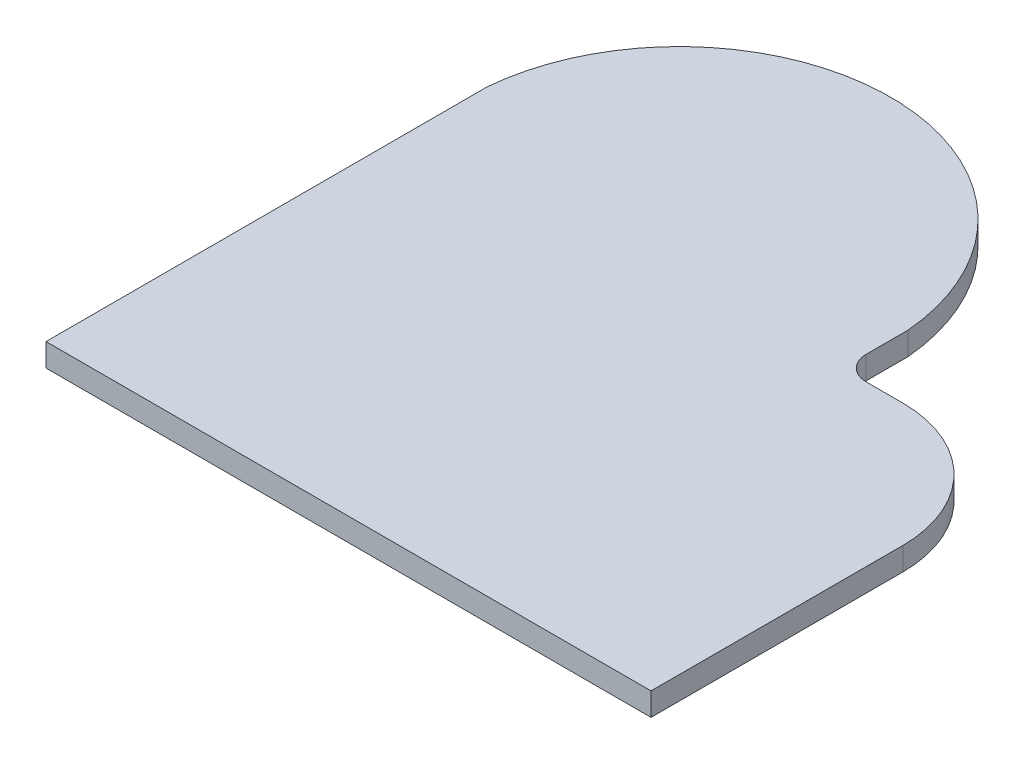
ISO-10303-21;
HEADER;
FILE_DESCRIPTION(('STEP AP214'),'2;1');
FILE_NAME('part.step','',(''),(''),'','','');
FILE_SCHEMA(('AUTOMOTIVE_DESIGN { 1 0 10303 214 1 1 1 1 }'));
ENDSEC;
DATA;
#1=APPLICATION_CONTEXT('core data for automotive mechanical design processes');
#2=APPLICATION_PROTOCOL_DEFINITION('international standard','automotive_design',2000,#1);
#3=PRODUCT_CONTEXT('',#1,'mechanical');
#4=PRODUCT('Part','Part','',(#3));
#5=PRODUCT_RELATED_PRODUCT_CATEGORY('part','',(#4));
#6=PRODUCT_DEFINITION_FORMATION('','',#4);
#7=PRODUCT_DEFINITION_CONTEXT('part definition',#1,'design');
#8=PRODUCT_DEFINITION('design','',#6,#7);
#9=PRODUCT_DEFINITION_SHAPE('','',#8);
#10=(LENGTH_UNIT() NAMED_UNIT(*) SI_UNIT(.MILLI.,.METRE.));
#11=(NAMED_UNIT(*) PLANE_ANGLE_UNIT() SI_UNIT($,.RADIAN.));
#12=(NAMED_UNIT(*) SI_UNIT($,.STERADIAN.) SOLID_ANGLE_UNIT());
#13=UNCERTAINTY_MEASURE_WITH_UNIT(LENGTH_MEASURE(1.E-05),#10,'distance_accuracy_value','');
#14=(GEOMETRIC_REPRESENTATION_CONTEXT(3) GLOBAL_UNCERTAINTY_ASSIGNED_CONTEXT((#13)) GLOBAL_UNIT_ASSIGNED_CONTEXT((#10,
#11,#12)) REPRESENTATION_CONTEXT('',''));
#15=CARTESIAN_POINT('',(0.,0.,0.));
#16=DIRECTION('',(0.,0.,1.));
#17=DIRECTION('',(1.,0.,0.));
#18=AXIS2_PLACEMENT_3D('',#15,#16,#17);
#19=CARTESIAN_POINT('',(6.85799999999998,3.175,0.));
#20=DIRECTION('',(1.,0.,0.));
#21=DIRECTION('',(0.,0.,-1.));
#22=AXIS2_PLACEMENT_3D('',#19,#20,#21);
#23=PLANE('',#22);
#24=DIRECTION('',(0.,0.,1.));
#25=VECTOR('',#24,1.);
#26=CARTESIAN_POINT('',(6.85799999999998,0.,0.));
#27=LINE('',#26,#25);
#28=CARTESIAN_POINT('',(6.858,0.,10.16));
#29=VERTEX_POINT('',#28);
#30=CARTESIAN_POINT('',(6.858,0.,44.958));
#31=VERTEX_POINT('',#30);
#32=EDGE_CURVE('E143',#29,#31,#27,.T.);
#33=ORIENTED_EDGE('',*,*,#32,.F.);
#34=DIRECTION('',(0.,-1.,0.));
#35=VECTOR('',#34,1.);
#36=CARTESIAN_POINT('',(6.858,3.175,10.16));
#37=LINE('',#36,#35);
#38=CARTESIAN_POINT('',(6.858,3.175,10.16));
#39=VERTEX_POINT('',#38);
#40=EDGE_CURVE('E145',#39,#29,#37,.T.);
#41=ORIENTED_EDGE('',*,*,#40,.F.);
#42=DIRECTION('',(0.,0.,1.));
#43=VECTOR('',#42,1.);
#44=CARTESIAN_POINT('',(6.85799999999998,3.175,0.));
#45=LINE('',#44,#43);
#46=CARTESIAN_POINT('',(6.858,3.175,44.958));
#47=VERTEX_POINT('',#46);
#48=EDGE_CURVE('E208',#39,#47,#45,.T.);
#49=ORIENTED_EDGE('',*,*,#48,.T.);
#50=DIRECTION('',(0.,-1.,0.));
#51=VECTOR('',#50,1.);
#52=CARTESIAN_POINT('',(6.858,3.175,44.958));
#53=LINE('',#52,#51);
#54=EDGE_CURVE('E84',#47,#31,#53,.T.);
#55=ORIENTED_EDGE('',*,*,#54,.T.);
#56=EDGE_LOOP('',(#33,#41,#49,#55));
#57=FACE_BOUND('',#56,.T.);
#58=ADVANCED_FACE('F74',(#57),#23,.T.);
#59=CARTESIAN_POINT('',(-76.708,3.175,0.));
#60=DIRECTION('',(1.,0.,0.));
#61=DIRECTION('',(0.,0.,-1.));
#62=AXIS2_PLACEMENT_3D('',#59,#60,#61);
#63=PLANE('',#62);
#64=DIRECTION('',(0.,0.,1.));
#65=VECTOR('',#64,1.);
#66=CARTESIAN_POINT('',(-76.708,0.,0.));
#67=LINE('',#66,#65);
#68=CARTESIAN_POINT('',(-76.708,0.,-15.9537511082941));
#69=VERTEX_POINT('',#68);
#70=CARTESIAN_POINT('',(-76.708,0.,44.958));
#71=VERTEX_POINT('',#70);
#72=EDGE_CURVE('E150',#69,#71,#67,.T.);
#73=ORIENTED_EDGE('',*,*,#72,.T.);
#74=DIRECTION('',(0.,-1.,0.));
#75=VECTOR('',#74,1.);
#76=CARTESIAN_POINT('',(-76.708,3.175,44.958));
#77=LINE('',#76,#75);
#78=CARTESIAN_POINT('',(-76.708,3.175,44.958));
#79=VERTEX_POINT('',#78);
#80=EDGE_CURVE('E12',#79,#71,#77,.T.);
#81=ORIENTED_EDGE('',*,*,#80,.F.);
#82=DIRECTION('',(0.,0.,1.));
#83=VECTOR('',#82,1.);
#84=CARTESIAN_POINT('',(-76.708,3.175,0.));
#85=LINE('',#84,#83);
#86=CARTESIAN_POINT('',(-76.708,3.175,-15.9537511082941));
#87=VERTEX_POINT('',#86);
#88=EDGE_CURVE('E211',#87,#79,#85,.T.);
#89=ORIENTED_EDGE('',*,*,#88,.F.);
#90=DIRECTION('',(0.,-1.,0.));
#91=VECTOR('',#90,1.);
#92=CARTESIAN_POINT('',(-76.708,3.175,-15.9537511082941));
#93=LINE('',#92,#91);
#94=EDGE_CURVE('E78',#87,#69,#93,.T.);
#95=ORIENTED_EDGE('',*,*,#94,.T.);
#96=EDGE_LOOP('',(#73,#81,#89,#95));
#97=FACE_BOUND('',#96,.T.);
#98=ADVANCED_FACE('F222',(#97),#63,.F.);
#99=CARTESIAN_POINT('',(0.,3.175,44.958));
#100=DIRECTION('',(0.,0.,-1.));
#101=DIRECTION('',(-1.,0.,0.));
#102=AXIS2_PLACEMENT_3D('',#99,#100,#101);
#103=PLANE('',#102);
#104=DIRECTION('',(1.,0.,0.));
#105=VECTOR('',#104,1.);
#106=CARTESIAN_POINT('',(0.,0.,44.958));
#107=LINE('',#106,#105);
#108=EDGE_CURVE('E206',#71,#31,#107,.T.);
#109=ORIENTED_EDGE('',*,*,#108,.T.);
#110=ORIENTED_EDGE('',*,*,#54,.F.);
#111=DIRECTION('',(1.,0.,0.));
#112=VECTOR('',#111,1.);
#113=CARTESIAN_POINT('',(0.,3.175,44.958));
#114=LINE('',#113,#112);
#115=EDGE_CURVE('E93',#79,#47,#114,.T.);
#116=ORIENTED_EDGE('',*,*,#115,.F.);
#117=ORIENTED_EDGE('',*,*,#80,.T.);
#118=EDGE_LOOP('',(#109,#110,#116,#117));
#119=FACE_BOUND('',#118,.T.);
#120=ADVANCED_FACE('F215',(#119),#103,.F.);
#121=CARTESIAN_POINT('',(0.,3.175,0.));
#122=DIRECTION('',(0.,1.,0.));
#123=DIRECTION('',(0.,0.,1.));
#124=AXIS2_PLACEMENT_3D('',#121,#122,#123);
#125=PLANE('',#124);
#126=ORIENTED_EDGE('',*,*,#48,.F.);
#127=CARTESIAN_POINT('',(-10.16,3.175,10.16));
#128=DIRECTION('',(0.,1.,0.));
#129=DIRECTION('',(0.,0.,1.));
#130=AXIS2_PLACEMENT_3D('',#127,#128,#129);
#131=CIRCLE('',#130,17.018);
#132=CARTESIAN_POINT('',(-10.16,3.175,-6.858));
#133=VERTEX_POINT('',#132);
#134=EDGE_CURVE('E153',#39,#133,#131,.T.);
#135=ORIENTED_EDGE('',*,*,#134,.T.);
#136=DIRECTION('',(-1.,0.,0.));
#137=VECTOR('',#136,1.);
#138=CARTESIAN_POINT('',(-10.16,3.175,-6.858));
#139=LINE('',#138,#137);
#140=CARTESIAN_POINT('',(-15.24,3.175,-6.858));
#141=VERTEX_POINT('',#140);
#142=EDGE_CURVE('E182',#133,#141,#139,.T.);
#143=ORIENTED_EDGE('',*,*,#142,.T.);
#144=CARTESIAN_POINT('',(-15.24,3.175,-10.16));
#145=DIRECTION('',(0.,-1.,0.));
#146=DIRECTION('',(0.,0.,-1.));
#147=AXIS2_PLACEMENT_3D('',#144,#145,#146);
#148=CIRCLE('',#147,3.302);
#149=CARTESIAN_POINT('',(-18.542,3.175,-10.16));
#150=VERTEX_POINT('',#149);
#151=EDGE_CURVE('E184',#141,#150,#148,.T.);
#152=ORIENTED_EDGE('',*,*,#151,.T.);
#153=DIRECTION('',(0.,0.,1.));
#154=VECTOR('',#153,1.);
#155=CARTESIAN_POINT('',(-18.5419999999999,3.175,-15.9537511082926));
#156=LINE('',#155,#154);
#157=CARTESIAN_POINT('',(-18.5419999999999,3.175,-15.9537511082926));
#158=VERTEX_POINT('',#157);
#159=EDGE_CURVE('E163',#158,#150,#156,.T.);
#160=ORIENTED_EDGE('',*,*,#159,.F.);
#161=CARTESIAN_POINT('',(-47.625,3.175,-13.4125578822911));
#162=DIRECTION('',(0.,1.,0.));
#163=DIRECTION('',(0.,0.,1.));
#164=AXIS2_PLACEMENT_3D('',#161,#162,#163);
#165=CIRCLE('',#164,29.1938101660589);
#166=EDGE_CURVE('E160',#158,#87,#165,.T.);
#167=ORIENTED_EDGE('',*,*,#166,.T.);
#168=ORIENTED_EDGE('',*,*,#88,.T.);
#169=ORIENTED_EDGE('',*,*,#115,.T.);
#170=EDGE_LOOP('',(#126,#135,#143,#152,#160,#167,#168,#169));
#171=FACE_BOUND('',#170,.T.);
#172=ADVANCED_FACE('F213',(#171),#125,.T.);
#173=CARTESIAN_POINT('',(0.,0.,0.));
#174=DIRECTION('',(0.,1.,0.));
#175=DIRECTION('',(0.,0.,1.));
#176=AXIS2_PLACEMENT_3D('',#173,#174,#175);
#177=PLANE('',#176);
#178=ORIENTED_EDGE('',*,*,#32,.T.);
#179=ORIENTED_EDGE('',*,*,#108,.F.);
#180=ORIENTED_EDGE('',*,*,#72,.F.);
#181=CARTESIAN_POINT('',(-47.625,0.,-13.4125578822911));
#182=DIRECTION('',(0.,1.,0.));
#183=DIRECTION('',(0.,0.,1.));
#184=AXIS2_PLACEMENT_3D('',#181,#182,#183);
#185=CIRCLE('',#184,29.1938101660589);
#186=CARTESIAN_POINT('',(-18.5419999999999,0.,-15.9537511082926));
#187=VERTEX_POINT('',#186);
#188=EDGE_CURVE('E188',#187,#69,#185,.T.);
#189=ORIENTED_EDGE('',*,*,#188,.F.);
#190=DIRECTION('',(0.,0.,1.));
#191=VECTOR('',#190,1.);
#192=CARTESIAN_POINT('',(-18.5419999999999,0.,-15.9537511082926));
#193=LINE('',#192,#191);
#194=CARTESIAN_POINT('',(-18.542,0.,-10.16));
#195=VERTEX_POINT('',#194);
#196=EDGE_CURVE('E190',#187,#195,#193,.T.);
#197=ORIENTED_EDGE('',*,*,#196,.T.);
#198=CARTESIAN_POINT('',(-15.24,0.,-10.16));
#199=DIRECTION('',(0.,-1.,0.));
#200=DIRECTION('',(0.,0.,-1.));
#201=AXIS2_PLACEMENT_3D('',#198,#199,#200);
#202=CIRCLE('',#201,3.302);
#203=CARTESIAN_POINT('',(-15.24,0.,-6.858));
#204=VERTEX_POINT('',#203);
#205=EDGE_CURVE('E165',#204,#195,#202,.T.);
#206=ORIENTED_EDGE('',*,*,#205,.F.);
#207=DIRECTION('',(-1.,0.,0.));
#208=VECTOR('',#207,1.);
#209=CARTESIAN_POINT('',(-10.16,0.,-6.858));
#210=LINE('',#209,#208);
#211=CARTESIAN_POINT('',(-10.16,0.,-6.858));
#212=VERTEX_POINT('',#211);
#213=EDGE_CURVE('E159',#212,#204,#210,.T.);
#214=ORIENTED_EDGE('',*,*,#213,.F.);
#215=CARTESIAN_POINT('',(-10.16,0.,10.16));
#216=DIRECTION('',(0.,1.,0.));
#217=DIRECTION('',(0.,0.,1.));
#218=AXIS2_PLACEMENT_3D('',#215,#216,#217);
#219=CIRCLE('',#218,17.018);
#220=EDGE_CURVE('E137',#29,#212,#219,.T.);
#221=ORIENTED_EDGE('',*,*,#220,.F.);
#222=EDGE_LOOP('',(#178,#179,#180,#189,#197,#206,#214,#221));
#223=FACE_BOUND('',#222,.T.);
#224=ADVANCED_FACE('F157',(#223),#177,.F.);
#225=CARTESIAN_POINT('',(-47.625,3.175,-13.4125578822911));
#226=DIRECTION('',(0.,-1.,0.));
#227=DIRECTION('',(0.,0.,-1.));
#228=AXIS2_PLACEMENT_3D('',#225,#226,#227);
#229=CYLINDRICAL_SURFACE('',#228,29.1938101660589);
#230=ORIENTED_EDGE('',*,*,#188,.T.);
#231=ORIENTED_EDGE('',*,*,#94,.F.);
#232=ORIENTED_EDGE('',*,*,#166,.F.);
#233=DIRECTION('',(0.,-1.,0.));
#234=VECTOR('',#233,1.);
#235=CARTESIAN_POINT('',(-18.5419999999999,3.175,-15.9537511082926));
#236=LINE('',#235,#234);
#237=EDGE_CURVE('E174',#158,#187,#236,.T.);
#238=ORIENTED_EDGE('',*,*,#237,.T.);
#239=EDGE_LOOP('',(#230,#231,#232,#238));
#240=FACE_BOUND('',#239,.T.);
#241=ADVANCED_FACE('F76',(#240),#229,.T.);
#242=CARTESIAN_POINT('',(-18.5419999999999,3.175,-15.9537511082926));
#243=DIRECTION('',(1.,0.,0.));
#244=DIRECTION('',(0.,0.,-1.));
#245=AXIS2_PLACEMENT_3D('',#242,#243,#244);
#246=PLANE('',#245);
#247=ORIENTED_EDGE('',*,*,#196,.F.);
#248=ORIENTED_EDGE('',*,*,#237,.F.);
#249=ORIENTED_EDGE('',*,*,#159,.T.);
#250=DIRECTION('',(0.,-1.,0.));
#251=VECTOR('',#250,1.);
#252=CARTESIAN_POINT('',(-18.542,3.175,-10.16));
#253=LINE('',#252,#251);
#254=EDGE_CURVE('E173',#150,#195,#253,.T.);
#255=ORIENTED_EDGE('',*,*,#254,.T.);
#256=EDGE_LOOP('',(#247,#248,#249,#255));
#257=FACE_BOUND('',#256,.T.);
#258=ADVANCED_FACE('F201',(#257),#246,.T.);
#259=CARTESIAN_POINT('',(-15.24,3.175,-10.16));
#260=DIRECTION('',(0.,-1.,0.));
#261=DIRECTION('',(0.,0.,-1.));
#262=AXIS2_PLACEMENT_3D('',#259,#260,#261);
#263=CYLINDRICAL_SURFACE('',#262,3.302);
#264=ORIENTED_EDGE('',*,*,#205,.T.);
#265=ORIENTED_EDGE('',*,*,#254,.F.);
#266=ORIENTED_EDGE('',*,*,#151,.F.);
#267=DIRECTION('',(0.,-1.,0.));
#268=VECTOR('',#267,1.);
#269=CARTESIAN_POINT('',(-15.24,3.175,-6.858));
#270=LINE('',#269,#268);
#271=EDGE_CURVE('E170',#141,#204,#270,.T.);
#272=ORIENTED_EDGE('',*,*,#271,.T.);
#273=EDGE_LOOP('',(#264,#265,#266,#272));
#274=FACE_BOUND('',#273,.T.);
#275=ADVANCED_FACE('F195',(#274),#263,.F.);
#276=CARTESIAN_POINT('',(-10.16,3.175,-6.858));
#277=DIRECTION('',(0.,0.,1.));
#278=DIRECTION('',(1.,0.,0.));
#279=AXIS2_PLACEMENT_3D('',#276,#277,#278);
#280=PLANE('',#279);
#281=ORIENTED_EDGE('',*,*,#213,.T.);
#282=ORIENTED_EDGE('',*,*,#271,.F.);
#283=ORIENTED_EDGE('',*,*,#142,.F.);
#284=DIRECTION('',(0.,-1.,0.));
#285=VECTOR('',#284,1.);
#286=CARTESIAN_POINT('',(-10.16,3.175,-6.858));
#287=LINE('',#286,#285);
#288=EDGE_CURVE('E154',#133,#212,#287,.T.);
#289=ORIENTED_EDGE('',*,*,#288,.T.);
#290=EDGE_LOOP('',(#281,#282,#283,#289));
#291=FACE_BOUND('',#290,.T.);
#292=ADVANCED_FACE('F226',(#291),#280,.F.);
#293=CARTESIAN_POINT('',(-10.16,3.175,10.16));
#294=DIRECTION('',(0.,-1.,0.));
#295=DIRECTION('',(0.,0.,-1.));
#296=AXIS2_PLACEMENT_3D('',#293,#294,#295);
#297=CYLINDRICAL_SURFACE('',#296,17.018);
#298=ORIENTED_EDGE('',*,*,#220,.T.);
#299=ORIENTED_EDGE('',*,*,#288,.F.);
#300=ORIENTED_EDGE('',*,*,#134,.F.);
#301=ORIENTED_EDGE('',*,*,#40,.T.);
#302=EDGE_LOOP('',(#298,#299,#300,#301));
#303=FACE_BOUND('',#302,.T.);
#304=ADVANCED_FACE('F152',(#303),#297,.T.);
#305=CLOSED_SHELL('',(#58,#98,#120,#172,#224,#241,#258,#275,#292,#304));
#306=MANIFOLD_SOLID_BREP('B2',#305);
#307=ADVANCED_BREP_SHAPE_REPRESENTATION('',(#18,#306),#14);
#308=SHAPE_DEFINITION_REPRESENTATION(#9,#307);
ENDSEC;
END-ISO-10303-21;
